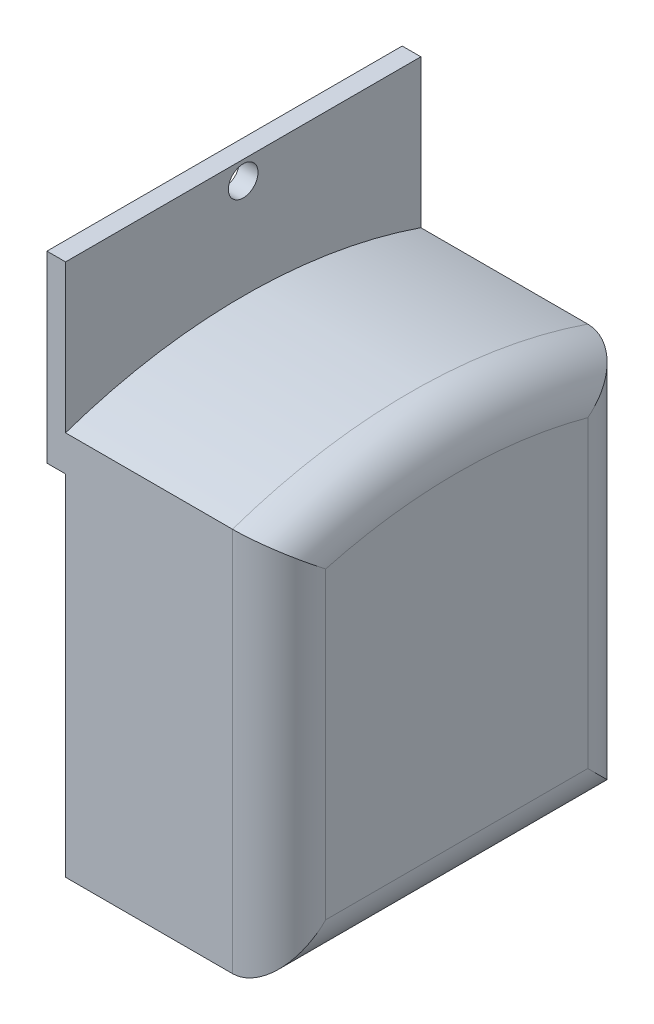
from build123d import *

# Parameters (mm, degrees)
BOSS_EXTRUDE1_DEPTH = 76.2
SKETCH2_R           = 3.174999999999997
CUT_EXTRUDE1_DEPTH  = 76.2
CUT_EXTRUDE3_DEPTH  = 45.8
BOSS_EXTRUDE2_DEPTH = 76.2
FILLET3_R           = 10


with BuildPart() as part:
    # Sketch1 → Boss-Extrude1 (new body)
    with BuildSketch(Plane.XY):
        Polygon((0, 0), (-1.353e-14, 49.513226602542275), (-4, 49.513226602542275), (-4, 88.9), (-2.082e-14, 88.9), (-2.082e-14, 76.2), (45.79999999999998, 76.2), (45.8, 0), align=None)
    extrude(amount=BOSS_EXTRUDE1_DEPTH)

    # Sketch2 → Cut-Extrude1 (cut)
    with BuildSketch(Plane(origin=(0, 0, 0), x_dir=(0, 0, -1), z_dir=(1, 0, 0))):
        with Locations((-38.1, 84.9)):
            Circle(SKETCH2_R)
    extrude(amount=-CUT_EXTRUDE1_DEPTH, mode=Mode.SUBTRACT)

    # Sketch3 → Cut-Extrude3 (cut)
    with BuildSketch(Plane(origin=(45.8, 1.251e-14, 0), x_dir=(0, 0, -1), z_dir=(1, 2.7e-16, 0))):
        with BuildLine():
            Line((0, 76.19999999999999), (-38.1, 76.19999999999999))
            Line((-38.1, 76.19999999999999), (-38.1, 63.5216680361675))
            ThreePointArc((-38.0999999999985, 63.52166803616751), (-18.78544490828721, 61.91776655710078), (0, 57.14999999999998))
            Line((-5e-17, 57.14999999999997), (0, 76.19999999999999))
        make_face()
        with BuildLine():
            Line((-38.1, 63.5216680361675), (-38.1, 76.19999999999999))
            Line((-38.1, 76.19999999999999), (-76.2, 76.19999999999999))
            Line((-76.2, 76.19999999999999), (-76.2, 57.14999999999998))
            ThreePointArc((-76.20000000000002, 57.14999999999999), (-57.414555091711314, 61.91776655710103), (-38.0999999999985, 63.52166803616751))
        make_face()
    extrude(amount=-CUT_EXTRUDE3_DEPTH, mode=Mode.SUBTRACT)

    # Sketch4 → Boss-Extrude2 (add)
    with BuildSketch(Plane.XY.offset(76.2)):
        Polygon((0, 0), (0, -25.400000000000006), (45.8, -25.4), (45.8, 0), align=None)
    extrude(amount=-BOSS_EXTRUDE2_DEPTH)

    # Fillet3
    fillet3_edges = [part.edges().sort_by_distance(p)[0] for p in [
        (45.79999999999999, 15.874999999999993, 1e-17),
        (45.79999999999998, 63.52166803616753, 38.099999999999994),
        (45.8, -25.4, 38.1),
        (45.79999999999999, 15.875, 76.20000000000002),
    ]]
    fillet(fillet3_edges, radius=FILLET3_R)


solid = part.part
